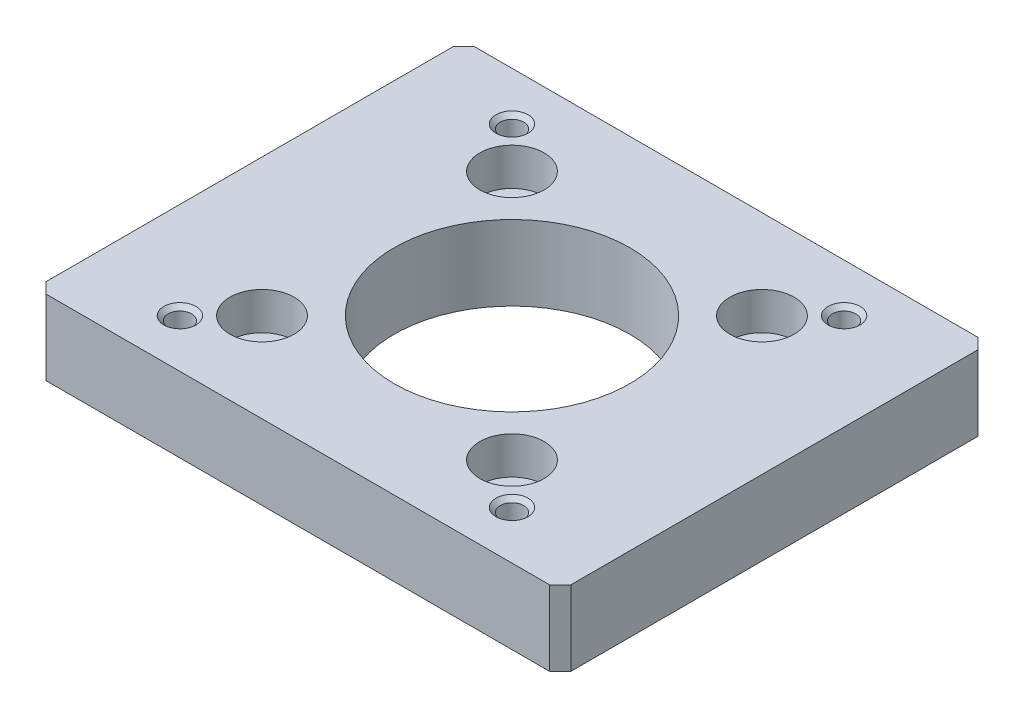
ISO-10303-21;
HEADER;
FILE_DESCRIPTION(('STEP AP214'),'2;1');
FILE_NAME('part.step','',(''),(''),'','','');
FILE_SCHEMA(('AUTOMOTIVE_DESIGN { 1 0 10303 214 1 1 1 1 }'));
ENDSEC;
DATA;
#1=APPLICATION_CONTEXT('core data for automotive mechanical design processes');
#2=APPLICATION_PROTOCOL_DEFINITION('international standard','automotive_design',2000,#1);
#3=PRODUCT_CONTEXT('',#1,'mechanical');
#4=PRODUCT('Part','Part','',(#3));
#5=PRODUCT_RELATED_PRODUCT_CATEGORY('part','',(#4));
#6=PRODUCT_DEFINITION_FORMATION('','',#4);
#7=PRODUCT_DEFINITION_CONTEXT('part definition',#1,'design');
#8=PRODUCT_DEFINITION('design','',#6,#7);
#9=PRODUCT_DEFINITION_SHAPE('','',#8);
#10=(LENGTH_UNIT() NAMED_UNIT(*) SI_UNIT(.MILLI.,.METRE.));
#11=(NAMED_UNIT(*) PLANE_ANGLE_UNIT() SI_UNIT($,.RADIAN.));
#12=(NAMED_UNIT(*) SI_UNIT($,.STERADIAN.) SOLID_ANGLE_UNIT());
#13=UNCERTAINTY_MEASURE_WITH_UNIT(LENGTH_MEASURE(1.E-05),#10,'distance_accuracy_value','');
#14=(GEOMETRIC_REPRESENTATION_CONTEXT(3) GLOBAL_UNCERTAINTY_ASSIGNED_CONTEXT((#13)) GLOBAL_UNIT_ASSIGNED_CONTEXT((#10,
#11,#12)) REPRESENTATION_CONTEXT('',''));
#15=CARTESIAN_POINT('',(0.,0.,0.));
#16=DIRECTION('',(0.,0.,1.));
#17=DIRECTION('',(1.,0.,0.));
#18=AXIS2_PLACEMENT_3D('',#15,#16,#17);
#19=CARTESIAN_POINT('',(-15.5,6.60000000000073,-15.5));
#20=DIRECTION('',(0.,1.,0.));
#21=DIRECTION('',(0.,0.,1.));
#22=AXIS2_PLACEMENT_3D('',#19,#20,#21);
#23=CONICAL_SURFACE('',#22,1.09999999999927,0.785398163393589);
#24=CARTESIAN_POINT('',(-15.5,6.6,-15.5));
#25=DIRECTION('',(0.,1.,0.));
#26=DIRECTION('',(1.,0.,0.));
#27=AXIS2_PLACEMENT_3D('',#24,#25,#26);
#28=CIRCLE('',#27,1.1);
#29=CARTESIAN_POINT('',(-14.4,6.6,-15.5));
#30=VERTEX_POINT('',#29);
#31=EDGE_CURVE('E191',#30,#30,#28,.F.);
#32=ORIENTED_EDGE('',*,*,#31,.T.);
#33=EDGE_LOOP('',(#32));
#34=FACE_BOUND('',#33,.T.);
#35=CARTESIAN_POINT('',(-15.5,7.00000000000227,-15.5));
#36=DIRECTION('',(0.,1.,0.));
#37=DIRECTION('',(0.,0.,1.));
#38=AXIS2_PLACEMENT_3D('',#35,#36,#37);
#39=CIRCLE('',#38,1.49999999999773);
#40=CARTESIAN_POINT('',(-15.5,7.00000000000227,-14.0000000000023));
#41=VERTEX_POINT('',#40);
#42=EDGE_CURVE('E174',#41,#41,#39,.T.);
#43=ORIENTED_EDGE('',*,*,#42,.T.);
#44=EDGE_LOOP('',(#43));
#45=FACE_BOUND('',#44,.T.);
#46=ADVANCED_FACE('F16',(#34,#45),#23,.F.);
#47=CARTESIAN_POINT('',(15.5,6.60000000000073,-15.5));
#48=DIRECTION('',(0.,1.,0.));
#49=DIRECTION('',(0.,0.,1.));
#50=AXIS2_PLACEMENT_3D('',#47,#48,#49);
#51=CONICAL_SURFACE('',#50,1.09999999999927,0.785398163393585);
#52=CARTESIAN_POINT('',(15.5,6.6,-15.5));
#53=DIRECTION('',(0.,1.,0.));
#54=DIRECTION('',(1.,0.,0.));
#55=AXIS2_PLACEMENT_3D('',#52,#53,#54);
#56=CIRCLE('',#55,1.1);
#57=CARTESIAN_POINT('',(16.6,6.6,-15.5));
#58=VERTEX_POINT('',#57);
#59=EDGE_CURVE('E195',#58,#58,#56,.F.);
#60=ORIENTED_EDGE('',*,*,#59,.T.);
#61=EDGE_LOOP('',(#60));
#62=FACE_BOUND('',#61,.T.);
#63=CARTESIAN_POINT('',(15.5,7.00000000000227,-15.5));
#64=DIRECTION('',(0.,1.,0.));
#65=DIRECTION('',(0.,0.,1.));
#66=AXIS2_PLACEMENT_3D('',#63,#64,#65);
#67=CIRCLE('',#66,1.49999999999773);
#68=CARTESIAN_POINT('',(15.5,7.00000000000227,-14.0000000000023));
#69=VERTEX_POINT('',#68);
#70=EDGE_CURVE('E171',#69,#69,#67,.T.);
#71=ORIENTED_EDGE('',*,*,#70,.T.);
#72=EDGE_LOOP('',(#71));
#73=FACE_BOUND('',#72,.T.);
#74=ADVANCED_FACE('F359',(#62,#73),#51,.F.);
#75=CARTESIAN_POINT('',(-15.5,6.60000000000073,15.5));
#76=DIRECTION('',(0.,1.,0.));
#77=DIRECTION('',(-1.,0.,0.));
#78=AXIS2_PLACEMENT_3D('',#75,#76,#77);
#79=CONICAL_SURFACE('',#78,1.09999999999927,0.785398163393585);
#80=CARTESIAN_POINT('',(-15.5,6.6,15.5));
#81=DIRECTION('',(0.,1.,0.));
#82=DIRECTION('',(1.,0.,0.));
#83=AXIS2_PLACEMENT_3D('',#80,#81,#82);
#84=CIRCLE('',#83,1.1);
#85=CARTESIAN_POINT('',(-14.4,6.6,15.5));
#86=VERTEX_POINT('',#85);
#87=EDGE_CURVE('E208',#86,#86,#84,.F.);
#88=ORIENTED_EDGE('',*,*,#87,.T.);
#89=EDGE_LOOP('',(#88));
#90=FACE_BOUND('',#89,.T.);
#91=CARTESIAN_POINT('',(-15.5,7.00000000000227,15.5));
#92=DIRECTION('',(0.,1.,0.));
#93=DIRECTION('',(-1.,0.,0.));
#94=AXIS2_PLACEMENT_3D('',#91,#92,#93);
#95=CIRCLE('',#94,1.49999999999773);
#96=CARTESIAN_POINT('',(-16.9999999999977,7.00000000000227,15.5));
#97=VERTEX_POINT('',#96);
#98=EDGE_CURVE('E168',#97,#97,#95,.T.);
#99=ORIENTED_EDGE('',*,*,#98,.T.);
#100=EDGE_LOOP('',(#99));
#101=FACE_BOUND('',#100,.T.);
#102=ADVANCED_FACE('F355',(#90,#101),#79,.F.);
#103=CARTESIAN_POINT('',(15.5,6.60000000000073,15.5));
#104=DIRECTION('',(0.,1.,0.));
#105=DIRECTION('',(0.,0.,1.));
#106=AXIS2_PLACEMENT_3D('',#103,#104,#105);
#107=CONICAL_SURFACE('',#106,1.09999999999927,0.785398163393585);
#108=CARTESIAN_POINT('',(15.5,6.6,15.5));
#109=DIRECTION('',(0.,1.,0.));
#110=DIRECTION('',(1.,0.,0.));
#111=AXIS2_PLACEMENT_3D('',#108,#109,#110);
#112=CIRCLE('',#111,1.1);
#113=CARTESIAN_POINT('',(16.6,6.6,15.5));
#114=VERTEX_POINT('',#113);
#115=EDGE_CURVE('E200',#114,#114,#112,.F.);
#116=ORIENTED_EDGE('',*,*,#115,.T.);
#117=EDGE_LOOP('',(#116));
#118=FACE_BOUND('',#117,.T.);
#119=CARTESIAN_POINT('',(15.5,7.00000000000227,15.5));
#120=DIRECTION('',(0.,1.,0.));
#121=DIRECTION('',(0.,0.,1.));
#122=AXIS2_PLACEMENT_3D('',#119,#120,#121);
#123=CIRCLE('',#122,1.49999999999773);
#124=CARTESIAN_POINT('',(15.5,7.00000000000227,16.9999999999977));
#125=VERTEX_POINT('',#124);
#126=EDGE_CURVE('E165',#125,#125,#123,.T.);
#127=ORIENTED_EDGE('',*,*,#126,.T.);
#128=EDGE_LOOP('',(#127));
#129=FACE_BOUND('',#128,.T.);
#130=ADVANCED_FACE('F352',(#118,#129),#107,.F.);
#131=CARTESIAN_POINT('',(11.66726188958,3.5,-11.66726188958));
#132=DIRECTION('',(0.,1.,0.));
#133=DIRECTION('',(0.,0.,1.));
#134=AXIS2_PLACEMENT_3D('',#131,#132,#133);
#135=CYLINDRICAL_SURFACE('',#134,3.);
#136=CARTESIAN_POINT('',(11.66726188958,3.5,-11.66726188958));
#137=DIRECTION('',(0.,1.,0.));
#138=DIRECTION('',(0.,0.,1.));
#139=AXIS2_PLACEMENT_3D('',#136,#137,#138);
#140=CIRCLE('',#139,3.);
#141=CARTESIAN_POINT('',(11.66726188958,3.5,-8.66726188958));
#142=VERTEX_POINT('',#141);
#143=EDGE_CURVE('E20',#142,#142,#140,.F.);
#144=ORIENTED_EDGE('',*,*,#143,.T.);
#145=EDGE_LOOP('',(#144));
#146=FACE_BOUND('',#145,.T.);
#147=CARTESIAN_POINT('',(11.66726188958,7.,-11.66726188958));
#148=DIRECTION('',(0.,1.,0.));
#149=DIRECTION('',(0.,0.,1.));
#150=AXIS2_PLACEMENT_3D('',#147,#148,#149);
#151=CIRCLE('',#150,3.);
#152=CARTESIAN_POINT('',(11.66726188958,7.,-8.66726188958));
#153=VERTEX_POINT('',#152);
#154=EDGE_CURVE('E162',#153,#153,#151,.T.);
#155=ORIENTED_EDGE('',*,*,#154,.T.);
#156=EDGE_LOOP('',(#155));
#157=FACE_BOUND('',#156,.T.);
#158=ADVANCED_FACE('F348',(#146,#157),#135,.F.);
#159=CARTESIAN_POINT('',(-11.66726188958,3.5,-11.66726188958));
#160=DIRECTION('',(0.,1.,0.));
#161=DIRECTION('',(0.,0.,1.));
#162=AXIS2_PLACEMENT_3D('',#159,#160,#161);
#163=CYLINDRICAL_SURFACE('',#162,3.000000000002);
#164=CARTESIAN_POINT('',(-11.66726188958,3.5,-11.66726188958));
#165=DIRECTION('',(0.,1.,0.));
#166=DIRECTION('',(0.,0.,1.));
#167=AXIS2_PLACEMENT_3D('',#164,#165,#166);
#168=CIRCLE('',#167,3.000000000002);
#169=CARTESIAN_POINT('',(-11.66726188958,3.5,-8.667261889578));
#170=VERTEX_POINT('',#169);
#171=EDGE_CURVE('E184',#170,#170,#168,.F.);
#172=ORIENTED_EDGE('',*,*,#171,.T.);
#173=EDGE_LOOP('',(#172));
#174=FACE_BOUND('',#173,.T.);
#175=CARTESIAN_POINT('',(-11.66726188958,7.,-11.66726188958));
#176=DIRECTION('',(0.,1.,0.));
#177=DIRECTION('',(0.,0.,1.));
#178=AXIS2_PLACEMENT_3D('',#175,#176,#177);
#179=CIRCLE('',#178,3.000000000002);
#180=CARTESIAN_POINT('',(-11.66726188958,7.,-8.667261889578));
#181=VERTEX_POINT('',#180);
#182=EDGE_CURVE('E159',#181,#181,#179,.T.);
#183=ORIENTED_EDGE('',*,*,#182,.T.);
#184=EDGE_LOOP('',(#183));
#185=FACE_BOUND('',#184,.T.);
#186=ADVANCED_FACE('F344',(#174,#185),#163,.F.);
#187=CARTESIAN_POINT('',(-11.66726188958,3.5,11.66726188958));
#188=DIRECTION('',(0.,1.,0.));
#189=DIRECTION('',(0.,0.,1.));
#190=AXIS2_PLACEMENT_3D('',#187,#188,#189);
#191=CYLINDRICAL_SURFACE('',#190,3.000000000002);
#192=CARTESIAN_POINT('',(-11.66726188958,3.5,11.66726188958));
#193=DIRECTION('',(0.,1.,0.));
#194=DIRECTION('',(0.,0.,1.));
#195=AXIS2_PLACEMENT_3D('',#192,#193,#194);
#196=CIRCLE('',#195,3.000000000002);
#197=CARTESIAN_POINT('',(-11.66726188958,3.5,14.667261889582));
#198=VERTEX_POINT('',#197);
#199=EDGE_CURVE('E90',#198,#198,#196,.F.);
#200=ORIENTED_EDGE('',*,*,#199,.T.);
#201=EDGE_LOOP('',(#200));
#202=FACE_BOUND('',#201,.T.);
#203=CARTESIAN_POINT('',(-11.66726188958,7.,11.66726188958));
#204=DIRECTION('',(0.,1.,0.));
#205=DIRECTION('',(0.,0.,1.));
#206=AXIS2_PLACEMENT_3D('',#203,#204,#205);
#207=CIRCLE('',#206,3.000000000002);
#208=CARTESIAN_POINT('',(-11.66726188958,7.,14.667261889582));
#209=VERTEX_POINT('',#208);
#210=EDGE_CURVE('E107',#209,#209,#207,.T.);
#211=ORIENTED_EDGE('',*,*,#210,.T.);
#212=EDGE_LOOP('',(#211));
#213=FACE_BOUND('',#212,.T.);
#214=ADVANCED_FACE('F341',(#202,#213),#191,.F.);
#215=CARTESIAN_POINT('',(11.66726188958,3.5,11.66726188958));
#216=DIRECTION('',(0.,1.,0.));
#217=DIRECTION('',(0.,0.,1.));
#218=AXIS2_PLACEMENT_3D('',#215,#216,#217);
#219=CYLINDRICAL_SURFACE('',#218,3.);
#220=CARTESIAN_POINT('',(11.66726188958,3.5,11.66726188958));
#221=DIRECTION('',(0.,1.,0.));
#222=DIRECTION('',(0.,0.,1.));
#223=AXIS2_PLACEMENT_3D('',#220,#221,#222);
#224=CIRCLE('',#223,3.);
#225=CARTESIAN_POINT('',(11.66726188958,3.5,14.66726188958));
#226=VERTEX_POINT('',#225);
#227=EDGE_CURVE('E186',#226,#226,#224,.F.);
#228=ORIENTED_EDGE('',*,*,#227,.T.);
#229=EDGE_LOOP('',(#228));
#230=FACE_BOUND('',#229,.T.);
#231=CARTESIAN_POINT('',(11.66726188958,7.,11.66726188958));
#232=DIRECTION('',(0.,1.,0.));
#233=DIRECTION('',(0.,0.,1.));
#234=AXIS2_PLACEMENT_3D('',#231,#232,#233);
#235=CIRCLE('',#234,3.);
#236=CARTESIAN_POINT('',(11.66726188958,7.,14.66726188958));
#237=VERTEX_POINT('',#236);
#238=EDGE_CURVE('E104',#237,#237,#235,.T.);
#239=ORIENTED_EDGE('',*,*,#238,.T.);
#240=EDGE_LOOP('',(#239));
#241=FACE_BOUND('',#240,.T.);
#242=ADVANCED_FACE('F338',(#230,#241),#219,.F.);
#243=CARTESIAN_POINT('',(-24.55903957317,7.14,-18.94096042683));
#244=DIRECTION('',(-0.70710678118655,0.,-0.707106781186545));
#245=DIRECTION('',(0.707106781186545,0.,-0.70710678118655));
#246=AXIS2_PLACEMENT_3D('',#243,#244,#245);
#247=PLANE('',#246);
#248=DIRECTION('',(0.707106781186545,0.,-0.70710678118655));
#249=VECTOR('',#248,1.);
#250=CARTESIAN_POINT('',(-24.55903957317,7.,-18.94096042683));
#251=LINE('',#250,#249);
#252=CARTESIAN_POINT('',(-24.5,7.,-19.));
#253=VERTEX_POINT('',#252);
#254=CARTESIAN_POINT('',(-23.5,7.,-20.));
#255=VERTEX_POINT('',#254);
#256=EDGE_CURVE('E177',#253,#255,#251,.T.);
#257=ORIENTED_EDGE('',*,*,#256,.T.);
#258=DIRECTION('',(0.,1.,0.));
#259=VECTOR('',#258,1.);
#260=CARTESIAN_POINT('',(-23.5,3.5,-20.));
#261=LINE('',#260,#259);
#262=CARTESIAN_POINT('',(-23.5,0.,-20.));
#263=VERTEX_POINT('',#262);
#264=EDGE_CURVE('E100',#255,#263,#261,.F.);
#265=ORIENTED_EDGE('',*,*,#264,.T.);
#266=DIRECTION('',(-0.707106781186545,0.,0.70710678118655));
#267=VECTOR('',#266,1.);
#268=CARTESIAN_POINT('',(-24.,0.,-19.5));
#269=LINE('',#268,#267);
#270=CARTESIAN_POINT('',(-24.5,0.,-19.));
#271=VERTEX_POINT('',#270);
#272=EDGE_CURVE('E203',#271,#263,#269,.F.);
#273=ORIENTED_EDGE('',*,*,#272,.F.);
#274=DIRECTION('',(0.,-1.,0.));
#275=VECTOR('',#274,1.);
#276=CARTESIAN_POINT('',(-24.5,3.5,-19.));
#277=LINE('',#276,#275);
#278=EDGE_CURVE('E215',#271,#253,#277,.F.);
#279=ORIENTED_EDGE('',*,*,#278,.T.);
#280=EDGE_LOOP('',(#257,#265,#273,#279));
#281=FACE_BOUND('',#280,.T.);
#282=ADVANCED_FACE('F261',(#281),#247,.T.);
#283=CARTESIAN_POINT('',(-23.44096042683,7.14,20.05903957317));
#284=DIRECTION('',(-0.70710678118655,0.,0.707106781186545));
#285=DIRECTION('',(-0.707106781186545,0.,-0.70710678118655));
#286=AXIS2_PLACEMENT_3D('',#283,#284,#285);
#287=PLANE('',#286);
#288=DIRECTION('',(-0.707106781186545,0.,-0.70710678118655));
#289=VECTOR('',#288,1.);
#290=CARTESIAN_POINT('',(-23.44096042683,7.,20.05903957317));
#291=LINE('',#290,#289);
#292=CARTESIAN_POINT('',(-23.5,7.,20.));
#293=VERTEX_POINT('',#292);
#294=CARTESIAN_POINT('',(-24.5,7.,19.));
#295=VERTEX_POINT('',#294);
#296=EDGE_CURVE('E179',#293,#295,#291,.T.);
#297=ORIENTED_EDGE('',*,*,#296,.T.);
#298=DIRECTION('',(0.,1.,0.));
#299=VECTOR('',#298,1.);
#300=CARTESIAN_POINT('',(-24.5,3.5,19.));
#301=LINE('',#300,#299);
#302=CARTESIAN_POINT('',(-24.5,0.,19.));
#303=VERTEX_POINT('',#302);
#304=EDGE_CURVE('E214',#295,#303,#301,.F.);
#305=ORIENTED_EDGE('',*,*,#304,.T.);
#306=DIRECTION('',(0.707106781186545,0.,0.70710678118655));
#307=VECTOR('',#306,1.);
#308=CARTESIAN_POINT('',(-24.,0.,19.5));
#309=LINE('',#308,#307);
#310=CARTESIAN_POINT('',(-23.5,0.,20.));
#311=VERTEX_POINT('',#310);
#312=EDGE_CURVE('E257',#311,#303,#309,.F.);
#313=ORIENTED_EDGE('',*,*,#312,.F.);
#314=DIRECTION('',(0.,-1.,0.));
#315=VECTOR('',#314,1.);
#316=CARTESIAN_POINT('',(-23.5,3.5,20.));
#317=LINE('',#316,#315);
#318=EDGE_CURVE('E222',#311,#293,#317,.F.);
#319=ORIENTED_EDGE('',*,*,#318,.T.);
#320=EDGE_LOOP('',(#297,#305,#313,#319));
#321=FACE_BOUND('',#320,.T.);
#322=ADVANCED_FACE('F267',(#321),#287,.T.);
#323=CARTESIAN_POINT('',(23.44096042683,7.14,-20.05903957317));
#324=DIRECTION('',(0.70710678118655,0.,-0.707106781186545));
#325=DIRECTION('',(0.707106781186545,0.,0.70710678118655));
#326=AXIS2_PLACEMENT_3D('',#323,#324,#325);
#327=PLANE('',#326);
#328=DIRECTION('',(0.707106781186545,0.,0.70710678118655));
#329=VECTOR('',#328,1.);
#330=CARTESIAN_POINT('',(23.44096042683,7.,-20.05903957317));
#331=LINE('',#330,#329);
#332=CARTESIAN_POINT('',(23.5,7.,-20.));
#333=VERTEX_POINT('',#332);
#334=CARTESIAN_POINT('',(24.5,7.,-19.));
#335=VERTEX_POINT('',#334);
#336=EDGE_CURVE('E80',#333,#335,#331,.T.);
#337=ORIENTED_EDGE('',*,*,#336,.T.);
#338=DIRECTION('',(0.,1.,0.));
#339=VECTOR('',#338,1.);
#340=CARTESIAN_POINT('',(24.5,3.5,-19.));
#341=LINE('',#340,#339);
#342=CARTESIAN_POINT('',(24.5,0.,-19.));
#343=VERTEX_POINT('',#342);
#344=EDGE_CURVE('E113',#335,#343,#341,.F.);
#345=ORIENTED_EDGE('',*,*,#344,.T.);
#346=DIRECTION('',(-0.707106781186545,0.,-0.70710678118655));
#347=VECTOR('',#346,1.);
#348=CARTESIAN_POINT('',(24.,0.,-19.5));
#349=LINE('',#348,#347);
#350=CARTESIAN_POINT('',(23.5,0.,-20.));
#351=VERTEX_POINT('',#350);
#352=EDGE_CURVE('E103',#351,#343,#349,.F.);
#353=ORIENTED_EDGE('',*,*,#352,.F.);
#354=DIRECTION('',(0.,-1.,0.));
#355=VECTOR('',#354,1.);
#356=CARTESIAN_POINT('',(23.5,3.5,-20.));
#357=LINE('',#356,#355);
#358=EDGE_CURVE('E97',#351,#333,#357,.F.);
#359=ORIENTED_EDGE('',*,*,#358,.T.);
#360=EDGE_LOOP('',(#337,#345,#353,#359));
#361=FACE_BOUND('',#360,.T.);
#362=ADVANCED_FACE('F102',(#361),#327,.T.);
#363=CARTESIAN_POINT('',(24.55903957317,7.14,18.94096042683));
#364=DIRECTION('',(0.70710678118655,0.,0.707106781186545));
#365=DIRECTION('',(-0.707106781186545,0.,0.70710678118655));
#366=AXIS2_PLACEMENT_3D('',#363,#364,#365);
#367=PLANE('',#366);
#368=DIRECTION('',(-0.707106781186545,0.,0.70710678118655));
#369=VECTOR('',#368,1.);
#370=CARTESIAN_POINT('',(24.55903957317,7.,18.94096042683));
#371=LINE('',#370,#369);
#372=CARTESIAN_POINT('',(24.5,7.,19.));
#373=VERTEX_POINT('',#372);
#374=CARTESIAN_POINT('',(23.5,7.,20.));
#375=VERTEX_POINT('',#374);
#376=EDGE_CURVE('E89',#373,#375,#371,.T.);
#377=ORIENTED_EDGE('',*,*,#376,.T.);
#378=DIRECTION('',(0.,1.,0.));
#379=VECTOR('',#378,1.);
#380=CARTESIAN_POINT('',(23.5,3.5,20.));
#381=LINE('',#380,#379);
#382=CARTESIAN_POINT('',(23.5,0.,20.));
#383=VERTEX_POINT('',#382);
#384=EDGE_CURVE('E111',#375,#383,#381,.F.);
#385=ORIENTED_EDGE('',*,*,#384,.T.);
#386=DIRECTION('',(0.707106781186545,0.,-0.70710678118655));
#387=VECTOR('',#386,1.);
#388=CARTESIAN_POINT('',(24.,0.,19.5));
#389=LINE('',#388,#387);
#390=CARTESIAN_POINT('',(24.5,0.,19.));
#391=VERTEX_POINT('',#390);
#392=EDGE_CURVE('E35',#391,#383,#389,.F.);
#393=ORIENTED_EDGE('',*,*,#392,.F.);
#394=DIRECTION('',(0.,-1.,0.));
#395=VECTOR('',#394,1.);
#396=CARTESIAN_POINT('',(24.5,3.5,19.));
#397=LINE('',#396,#395);
#398=EDGE_CURVE('E114',#391,#373,#397,.F.);
#399=ORIENTED_EDGE('',*,*,#398,.T.);
#400=EDGE_LOOP('',(#377,#385,#393,#399));
#401=FACE_BOUND('',#400,.T.);
#402=ADVANCED_FACE('F228',(#401),#367,.T.);
#403=CARTESIAN_POINT('',(-15.5,0.4,15.5));
#404=DIRECTION('',(0.,1.,0.));
#405=DIRECTION('',(0.,0.,1.));
#406=AXIS2_PLACEMENT_3D('',#403,#404,#405);
#407=CYLINDRICAL_SURFACE('',#406,1.1);
#408=CARTESIAN_POINT('',(-15.5,0.399999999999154,15.5));
#409=DIRECTION('',(0.,-1.,0.));
#410=DIRECTION('',(0.,0.,-1.));
#411=AXIS2_PLACEMENT_3D('',#408,#409,#410);
#412=CIRCLE('',#411,1.09999999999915);
#413=CARTESIAN_POINT('',(-15.5,0.399999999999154,14.4000000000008));
#414=VERTEX_POINT('',#413);
#415=EDGE_CURVE('E227',#414,#414,#412,.T.);
#416=ORIENTED_EDGE('',*,*,#415,.T.);
#417=EDGE_LOOP('',(#416));
#418=FACE_BOUND('',#417,.T.);
#419=ORIENTED_EDGE('',*,*,#87,.F.);
#420=EDGE_LOOP('',(#419));
#421=FACE_BOUND('',#420,.T.);
#422=ADVANCED_FACE('F333',(#418,#421),#407,.F.);
#423=CARTESIAN_POINT('',(15.5,0.4,15.5));
#424=DIRECTION('',(0.,1.,0.));
#425=DIRECTION('',(0.,0.,1.));
#426=AXIS2_PLACEMENT_3D('',#423,#424,#425);
#427=CYLINDRICAL_SURFACE('',#426,1.1);
#428=CARTESIAN_POINT('',(15.5,0.399999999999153,15.5));
#429=DIRECTION('',(0.,-1.,0.));
#430=DIRECTION('',(0.,0.,-1.));
#431=AXIS2_PLACEMENT_3D('',#428,#429,#430);
#432=CIRCLE('',#431,1.09999999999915);
#433=CARTESIAN_POINT('',(15.5,0.399999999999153,14.4000000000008));
#434=VERTEX_POINT('',#433);
#435=EDGE_CURVE('E251',#434,#434,#432,.T.);
#436=ORIENTED_EDGE('',*,*,#435,.T.);
#437=EDGE_LOOP('',(#436));
#438=FACE_BOUND('',#437,.T.);
#439=ORIENTED_EDGE('',*,*,#115,.F.);
#440=EDGE_LOOP('',(#439));
#441=FACE_BOUND('',#440,.T.);
#442=ADVANCED_FACE('F329',(#438,#441),#427,.F.);
#443=CARTESIAN_POINT('',(15.5,0.4,-15.5));
#444=DIRECTION('',(0.,1.,0.));
#445=DIRECTION('',(0.,0.,1.));
#446=AXIS2_PLACEMENT_3D('',#443,#444,#445);
#447=CYLINDRICAL_SURFACE('',#446,1.1);
#448=CARTESIAN_POINT('',(15.5,0.399999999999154,-15.5));
#449=DIRECTION('',(0.,-1.,0.));
#450=DIRECTION('',(0.,0.,-1.));
#451=AXIS2_PLACEMENT_3D('',#448,#449,#450);
#452=CIRCLE('',#451,1.09999999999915);
#453=CARTESIAN_POINT('',(15.5,0.399999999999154,-16.5999999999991));
#454=VERTEX_POINT('',#453);
#455=EDGE_CURVE('E248',#454,#454,#452,.T.);
#456=ORIENTED_EDGE('',*,*,#455,.T.);
#457=EDGE_LOOP('',(#456));
#458=FACE_BOUND('',#457,.T.);
#459=ORIENTED_EDGE('',*,*,#59,.F.);
#460=EDGE_LOOP('',(#459));
#461=FACE_BOUND('',#460,.T.);
#462=ADVANCED_FACE('F325',(#458,#461),#447,.F.);
#463=CARTESIAN_POINT('',(-15.5,0.4,-15.5));
#464=DIRECTION('',(0.,1.,0.));
#465=DIRECTION('',(0.,0.,1.));
#466=AXIS2_PLACEMENT_3D('',#463,#464,#465);
#467=CYLINDRICAL_SURFACE('',#466,1.1);
#468=CARTESIAN_POINT('',(-15.5,0.399999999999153,-15.5));
#469=DIRECTION('',(0.,-1.,0.));
#470=DIRECTION('',(0.,0.,-1.));
#471=AXIS2_PLACEMENT_3D('',#468,#469,#470);
#472=CIRCLE('',#471,1.09999999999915);
#473=CARTESIAN_POINT('',(-15.5,0.399999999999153,-16.5999999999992));
#474=VERTEX_POINT('',#473);
#475=EDGE_CURVE('E155',#474,#474,#472,.T.);
#476=ORIENTED_EDGE('',*,*,#475,.T.);
#477=EDGE_LOOP('',(#476));
#478=FACE_BOUND('',#477,.T.);
#479=ORIENTED_EDGE('',*,*,#31,.F.);
#480=EDGE_LOOP('',(#479));
#481=FACE_BOUND('',#480,.T.);
#482=ADVANCED_FACE('F321',(#478,#481),#467,.F.);
#483=CARTESIAN_POINT('',(-15.25395236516,3.5,15.26045421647));
#484=DIRECTION('',(0.,1.,0.));
#485=DIRECTION('',(1.,0.,0.));
#486=AXIS2_PLACEMENT_3D('',#483,#484,#485);
#487=PLANE('',#486);
#488=CARTESIAN_POINT('',(11.66726188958,3.5,-11.66726188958));
#489=DIRECTION('',(0.,1.,0.));
#490=DIRECTION('',(0.,0.,1.));
#491=AXIS2_PLACEMENT_3D('',#488,#489,#490);
#492=CIRCLE('',#491,1.75);
#493=CARTESIAN_POINT('',(11.66726188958,3.5,-9.91726188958));
#494=VERTEX_POINT('',#493);
#495=EDGE_CURVE('E153',#494,#494,#492,.F.);
#496=ORIENTED_EDGE('',*,*,#495,.T.);
#497=EDGE_LOOP('',(#496));
#498=FACE_BOUND('',#497,.T.);
#499=ORIENTED_EDGE('',*,*,#143,.F.);
#500=EDGE_LOOP('',(#499));
#501=FACE_BOUND('',#500,.T.);
#502=ADVANCED_FACE('F324',(#498,#501),#487,.T.);
#503=CARTESIAN_POINT('',(-15.25395236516,3.5,15.26045421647));
#504=DIRECTION('',(0.,1.,0.));
#505=DIRECTION('',(1.,0.,0.));
#506=AXIS2_PLACEMENT_3D('',#503,#504,#505);
#507=PLANE('',#506);
#508=CARTESIAN_POINT('',(11.66726188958,3.5,11.66726188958));
#509=DIRECTION('',(0.,1.,0.));
#510=DIRECTION('',(0.,0.,1.));
#511=AXIS2_PLACEMENT_3D('',#508,#509,#510);
#512=CIRCLE('',#511,1.75);
#513=CARTESIAN_POINT('',(11.66726188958,3.5,13.41726188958));
#514=VERTEX_POINT('',#513);
#515=EDGE_CURVE('E150',#514,#514,#512,.F.);
#516=ORIENTED_EDGE('',*,*,#515,.T.);
#517=EDGE_LOOP('',(#516));
#518=FACE_BOUND('',#517,.T.);
#519=ORIENTED_EDGE('',*,*,#227,.F.);
#520=EDGE_LOOP('',(#519));
#521=FACE_BOUND('',#520,.T.);
#522=ADVANCED_FACE('F376',(#518,#521),#507,.T.);
#523=CARTESIAN_POINT('',(-15.25395236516,3.5,15.26045421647));
#524=DIRECTION('',(0.,1.,0.));
#525=DIRECTION('',(1.,0.,0.));
#526=AXIS2_PLACEMENT_3D('',#523,#524,#525);
#527=PLANE('',#526);
#528=CARTESIAN_POINT('',(-11.66726188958,3.5,-11.66726188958));
#529=DIRECTION('',(0.,1.,0.));
#530=DIRECTION('',(0.,0.,1.));
#531=AXIS2_PLACEMENT_3D('',#528,#529,#530);
#532=CIRCLE('',#531,1.75000000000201);
#533=CARTESIAN_POINT('',(-11.66726188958,3.5,-9.917261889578));
#534=VERTEX_POINT('',#533);
#535=EDGE_CURVE('E147',#534,#534,#532,.F.);
#536=ORIENTED_EDGE('',*,*,#535,.T.);
#537=EDGE_LOOP('',(#536));
#538=FACE_BOUND('',#537,.T.);
#539=ORIENTED_EDGE('',*,*,#171,.F.);
#540=EDGE_LOOP('',(#539));
#541=FACE_BOUND('',#540,.T.);
#542=ADVANCED_FACE('F380',(#538,#541),#527,.T.);
#543=CARTESIAN_POINT('',(-15.25395236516,3.5,15.26045421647));
#544=DIRECTION('',(0.,1.,0.));
#545=DIRECTION('',(1.,0.,0.));
#546=AXIS2_PLACEMENT_3D('',#543,#544,#545);
#547=PLANE('',#546);
#548=CARTESIAN_POINT('',(-11.66726188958,3.5,11.66726188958));
#549=DIRECTION('',(0.,1.,0.));
#550=DIRECTION('',(0.,0.,1.));
#551=AXIS2_PLACEMENT_3D('',#548,#549,#550);
#552=CIRCLE('',#551,1.75000000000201);
#553=CARTESIAN_POINT('',(-11.66726188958,3.5,13.417261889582));
#554=VERTEX_POINT('',#553);
#555=EDGE_CURVE('E144',#554,#554,#552,.F.);
#556=ORIENTED_EDGE('',*,*,#555,.T.);
#557=EDGE_LOOP('',(#556));
#558=FACE_BOUND('',#557,.T.);
#559=ORIENTED_EDGE('',*,*,#199,.F.);
#560=EDGE_LOOP('',(#559));
#561=FACE_BOUND('',#560,.T.);
#562=ADVANCED_FACE('F384',(#558,#561),#547,.T.);
#563=CARTESIAN_POINT('',(-25.48,7.,20.8));
#564=DIRECTION('',(0.,1.,0.));
#565=DIRECTION('',(1.,0.,0.));
#566=AXIS2_PLACEMENT_3D('',#563,#564,#565);
#567=PLANE('',#566);
#568=CARTESIAN_POINT('',(0.,7.,0.));
#569=DIRECTION('',(0.,1.,0.));
#570=DIRECTION('',(0.,0.,1.));
#571=AXIS2_PLACEMENT_3D('',#568,#569,#570);
#572=CIRCLE('',#571,11.);
#573=CARTESIAN_POINT('',(0.,7.,11.));
#574=VERTEX_POINT('',#573);
#575=EDGE_CURVE('E140',#574,#574,#572,.F.);
#576=ORIENTED_EDGE('',*,*,#575,.T.);
#577=EDGE_LOOP('',(#576));
#578=FACE_BOUND('',#577,.T.);
#579=ORIENTED_EDGE('',*,*,#238,.F.);
#580=EDGE_LOOP('',(#579));
#581=FACE_BOUND('',#580,.T.);
#582=ORIENTED_EDGE('',*,*,#210,.F.);
#583=EDGE_LOOP('',(#582));
#584=FACE_BOUND('',#583,.T.);
#585=ORIENTED_EDGE('',*,*,#182,.F.);
#586=EDGE_LOOP('',(#585));
#587=FACE_BOUND('',#586,.T.);
#588=ORIENTED_EDGE('',*,*,#154,.F.);
#589=EDGE_LOOP('',(#588));
#590=FACE_BOUND('',#589,.T.);
#591=ORIENTED_EDGE('',*,*,#126,.F.);
#592=EDGE_LOOP('',(#591));
#593=FACE_BOUND('',#592,.T.);
#594=ORIENTED_EDGE('',*,*,#98,.F.);
#595=EDGE_LOOP('',(#594));
#596=FACE_BOUND('',#595,.T.);
#597=ORIENTED_EDGE('',*,*,#70,.F.);
#598=EDGE_LOOP('',(#597));
#599=FACE_BOUND('',#598,.T.);
#600=ORIENTED_EDGE('',*,*,#42,.F.);
#601=EDGE_LOOP('',(#600));
#602=FACE_BOUND('',#601,.T.);
#603=ORIENTED_EDGE('',*,*,#256,.F.);
#604=DIRECTION('',(0.,0.,-1.));
#605=VECTOR('',#604,1.);
#606=CARTESIAN_POINT('',(-24.5,7.,0.));
#607=LINE('',#606,#605);
#608=EDGE_CURVE('E211',#253,#295,#607,.F.);
#609=ORIENTED_EDGE('',*,*,#608,.T.);
#610=ORIENTED_EDGE('',*,*,#296,.F.);
#611=DIRECTION('',(-1.,0.,0.));
#612=VECTOR('',#611,1.);
#613=CARTESIAN_POINT('',(0.,7.,20.));
#614=LINE('',#613,#612);
#615=EDGE_CURVE('E219',#293,#375,#614,.F.);
#616=ORIENTED_EDGE('',*,*,#615,.T.);
#617=ORIENTED_EDGE('',*,*,#376,.F.);
#618=DIRECTION('',(0.,0.,1.));
#619=VECTOR('',#618,1.);
#620=CARTESIAN_POINT('',(24.5,7.,0.));
#621=LINE('',#620,#619);
#622=EDGE_CURVE('E85',#373,#335,#621,.F.);
#623=ORIENTED_EDGE('',*,*,#622,.T.);
#624=ORIENTED_EDGE('',*,*,#336,.F.);
#625=DIRECTION('',(1.,0.,0.));
#626=VECTOR('',#625,1.);
#627=CARTESIAN_POINT('',(0.,7.,-20.));
#628=LINE('',#627,#626);
#629=EDGE_CURVE('E83',#333,#255,#628,.F.);
#630=ORIENTED_EDGE('',*,*,#629,.T.);
#631=EDGE_LOOP('',(#603,#609,#610,#616,#617,#623,#624,#630));
#632=FACE_BOUND('',#631,.T.);
#633=ADVANCED_FACE('F82',(#578,#581,#584,#587,#590,#593,#596,#599,#602,#632),#567,.T.);
#634=CARTESIAN_POINT('',(24.44,-0.14,-20.));
#635=DIRECTION('',(0.,0.,-1.));
#636=DIRECTION('',(-1.,0.,0.));
#637=AXIS2_PLACEMENT_3D('',#634,#635,#636);
#638=PLANE('',#637);
#639=ORIENTED_EDGE('',*,*,#264,.F.);
#640=ORIENTED_EDGE('',*,*,#629,.F.);
#641=ORIENTED_EDGE('',*,*,#358,.F.);
#642=DIRECTION('',(-1.,0.,0.));
#643=VECTOR('',#642,1.);
#644=CARTESIAN_POINT('',(0.,0.,-20.));
#645=LINE('',#644,#643);
#646=EDGE_CURVE('E143',#351,#263,#645,.T.);
#647=ORIENTED_EDGE('',*,*,#646,.T.);
#648=EDGE_LOOP('',(#639,#640,#641,#647));
#649=FACE_BOUND('',#648,.T.);
#650=ADVANCED_FACE('F95',(#649),#638,.T.);
#651=CARTESIAN_POINT('',(-24.5,-0.14,-19.76));
#652=DIRECTION('',(-1.,0.,0.));
#653=DIRECTION('',(0.,0.,1.));
#654=AXIS2_PLACEMENT_3D('',#651,#652,#653);
#655=PLANE('',#654);
#656=ORIENTED_EDGE('',*,*,#304,.F.);
#657=ORIENTED_EDGE('',*,*,#608,.F.);
#658=ORIENTED_EDGE('',*,*,#278,.F.);
#659=DIRECTION('',(0.,0.,1.));
#660=VECTOR('',#659,1.);
#661=CARTESIAN_POINT('',(-24.5,0.,0.));
#662=LINE('',#661,#660);
#663=EDGE_CURVE('E240',#271,#303,#662,.T.);
#664=ORIENTED_EDGE('',*,*,#663,.T.);
#665=EDGE_LOOP('',(#656,#657,#658,#664));
#666=FACE_BOUND('',#665,.T.);
#667=ADVANCED_FACE('F265',(#666),#655,.T.);
#668=CARTESIAN_POINT('',(-24.44,-0.14,20.));
#669=DIRECTION('',(0.,0.,1.));
#670=DIRECTION('',(1.,0.,0.));
#671=AXIS2_PLACEMENT_3D('',#668,#669,#670);
#672=PLANE('',#671);
#673=ORIENTED_EDGE('',*,*,#384,.F.);
#674=ORIENTED_EDGE('',*,*,#615,.F.);
#675=ORIENTED_EDGE('',*,*,#318,.F.);
#676=DIRECTION('',(1.,0.,0.));
#677=VECTOR('',#676,1.);
#678=CARTESIAN_POINT('',(0.,0.,20.));
#679=LINE('',#678,#677);
#680=EDGE_CURVE('E237',#311,#383,#679,.T.);
#681=ORIENTED_EDGE('',*,*,#680,.T.);
#682=EDGE_LOOP('',(#673,#674,#675,#681));
#683=FACE_BOUND('',#682,.T.);
#684=ADVANCED_FACE('F271',(#683),#672,.T.);
#685=CARTESIAN_POINT('',(24.5,-0.14,19.76));
#686=DIRECTION('',(1.,0.,0.));
#687=DIRECTION('',(0.,0.,-1.));
#688=AXIS2_PLACEMENT_3D('',#685,#686,#687);
#689=PLANE('',#688);
#690=ORIENTED_EDGE('',*,*,#398,.F.);
#691=DIRECTION('',(0.,0.,-1.));
#692=VECTOR('',#691,1.);
#693=CARTESIAN_POINT('',(24.5,0.,0.));
#694=LINE('',#693,#692);
#695=EDGE_CURVE('E139',#391,#343,#694,.T.);
#696=ORIENTED_EDGE('',*,*,#695,.T.);
#697=ORIENTED_EDGE('',*,*,#344,.F.);
#698=ORIENTED_EDGE('',*,*,#622,.F.);
#699=EDGE_LOOP('',(#690,#696,#697,#698));
#700=FACE_BOUND('',#699,.T.);
#701=ADVANCED_FACE('F233',(#700),#689,.T.);
#702=CARTESIAN_POINT('',(-15.5,0.399999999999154,15.5));
#703=DIRECTION('',(0.,-1.,0.));
#704=DIRECTION('',(1.,0.,0.));
#705=AXIS2_PLACEMENT_3D('',#702,#703,#704);
#706=CONICAL_SURFACE('',#705,1.09999999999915,0.785398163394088);
#707=ORIENTED_EDGE('',*,*,#415,.F.);
#708=EDGE_LOOP('',(#707));
#709=FACE_BOUND('',#708,.T.);
#710=CARTESIAN_POINT('',(-15.5,-2.19252784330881E-12,15.5));
#711=DIRECTION('',(0.,-1.,0.));
#712=DIRECTION('',(1.,0.,0.));
#713=AXIS2_PLACEMENT_3D('',#710,#711,#712);
#714=CIRCLE('',#713,1.49999999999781);
#715=CARTESIAN_POINT('',(-14.0000000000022,-2.19256480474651E-12,15.5));
#716=VERTEX_POINT('',#715);
#717=EDGE_CURVE('E136',#716,#716,#714,.T.);
#718=ORIENTED_EDGE('',*,*,#717,.T.);
#719=EDGE_LOOP('',(#718));
#720=FACE_BOUND('',#719,.T.);
#721=ADVANCED_FACE('F279',(#709,#720),#706,.F.);
#722=CARTESIAN_POINT('',(15.5,0.399999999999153,15.5));
#723=DIRECTION('',(0.,-1.,0.));
#724=DIRECTION('',(1.,0.,0.));
#725=AXIS2_PLACEMENT_3D('',#722,#723,#724);
#726=CONICAL_SURFACE('',#725,1.09999999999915,0.785398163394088);
#727=ORIENTED_EDGE('',*,*,#435,.F.);
#728=EDGE_LOOP('',(#727));
#729=FACE_BOUND('',#728,.T.);
#730=CARTESIAN_POINT('',(15.5,-2.1911725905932E-12,15.5));
#731=DIRECTION('',(0.,-1.,0.));
#732=DIRECTION('',(1.,0.,0.));
#733=AXIS2_PLACEMENT_3D('',#730,#731,#732);
#734=CIRCLE('',#733,1.49999999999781);
#735=CARTESIAN_POINT('',(16.9999999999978,-2.1912095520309E-12,15.5));
#736=VERTEX_POINT('',#735);
#737=EDGE_CURVE('E133',#736,#736,#734,.T.);
#738=ORIENTED_EDGE('',*,*,#737,.T.);
#739=EDGE_LOOP('',(#738));
#740=FACE_BOUND('',#739,.T.);
#741=ADVANCED_FACE('F309',(#729,#740),#726,.F.);
#742=CARTESIAN_POINT('',(15.5,0.399999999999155,-15.5));
#743=DIRECTION('',(0.,-1.,0.));
#744=DIRECTION('',(0.,0.,-1.));
#745=AXIS2_PLACEMENT_3D('',#742,#743,#744);
#746=CONICAL_SURFACE('',#745,1.09999999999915,0.785398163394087);
#747=ORIENTED_EDGE('',*,*,#455,.F.);
#748=EDGE_LOOP('',(#747));
#749=FACE_BOUND('',#748,.T.);
#750=CARTESIAN_POINT('',(15.5,-2.19225679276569E-12,-15.5));
#751=DIRECTION('',(0.,-1.,0.));
#752=DIRECTION('',(0.,0.,-1.));
#753=AXIS2_PLACEMENT_3D('',#750,#751,#752);
#754=CIRCLE('',#753,1.49999999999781);
#755=CARTESIAN_POINT('',(15.5,-2.19225679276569E-12,-16.9999999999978));
#756=VERTEX_POINT('',#755);
#757=EDGE_CURVE('E130',#756,#756,#754,.T.);
#758=ORIENTED_EDGE('',*,*,#757,.T.);
#759=EDGE_LOOP('',(#758));
#760=FACE_BOUND('',#759,.T.);
#761=ADVANCED_FACE('F315',(#749,#760),#746,.F.);
#762=CARTESIAN_POINT('',(-15.5,0.399999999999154,-15.5));
#763=DIRECTION('',(0.,-1.,0.));
#764=DIRECTION('',(0.,0.,-1.));
#765=AXIS2_PLACEMENT_3D('',#762,#763,#764);
#766=CONICAL_SURFACE('',#765,1.09999999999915,0.785398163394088);
#767=ORIENTED_EDGE('',*,*,#475,.F.);
#768=EDGE_LOOP('',(#767));
#769=FACE_BOUND('',#768,.T.);
#770=CARTESIAN_POINT('',(-15.5,-2.1913894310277E-12,-15.5));
#771=DIRECTION('',(0.,-1.,0.));
#772=DIRECTION('',(0.,0.,-1.));
#773=AXIS2_PLACEMENT_3D('',#770,#771,#772);
#774=CIRCLE('',#773,1.49999999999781);
#775=CARTESIAN_POINT('',(-15.5,-2.1913894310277E-12,-16.9999999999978));
#776=VERTEX_POINT('',#775);
#777=EDGE_CURVE('E127',#776,#776,#774,.T.);
#778=ORIENTED_EDGE('',*,*,#777,.T.);
#779=EDGE_LOOP('',(#778));
#780=FACE_BOUND('',#779,.T.);
#781=ADVANCED_FACE('F435',(#769,#780),#766,.F.);
#782=CARTESIAN_POINT('',(11.66726188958,0.,-11.66726188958));
#783=DIRECTION('',(0.,1.,0.));
#784=DIRECTION('',(0.,0.,1.));
#785=AXIS2_PLACEMENT_3D('',#782,#783,#784);
#786=CYLINDRICAL_SURFACE('',#785,1.75);
#787=CARTESIAN_POINT('',(11.66726188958,0.,-11.66726188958));
#788=DIRECTION('',(0.,1.,0.));
#789=DIRECTION('',(0.,0.,1.));
#790=AXIS2_PLACEMENT_3D('',#787,#788,#789);
#791=CIRCLE('',#790,1.75);
#792=CARTESIAN_POINT('',(11.66726188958,0.,-9.91726188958));
#793=VERTEX_POINT('',#792);
#794=EDGE_CURVE('E124',#793,#793,#791,.F.);
#795=ORIENTED_EDGE('',*,*,#794,.T.);
#796=EDGE_LOOP('',(#795));
#797=FACE_BOUND('',#796,.T.);
#798=ORIENTED_EDGE('',*,*,#495,.F.);
#799=EDGE_LOOP('',(#798));
#800=FACE_BOUND('',#799,.T.);
#801=ADVANCED_FACE('F444',(#797,#800),#786,.F.);
#802=CARTESIAN_POINT('',(11.66726188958,0.,11.66726188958));
#803=DIRECTION('',(0.,1.,0.));
#804=DIRECTION('',(0.,0.,1.));
#805=AXIS2_PLACEMENT_3D('',#802,#803,#804);
#806=CYLINDRICAL_SURFACE('',#805,1.75);
#807=CARTESIAN_POINT('',(11.66726188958,0.,11.66726188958));
#808=DIRECTION('',(0.,1.,0.));
#809=DIRECTION('',(0.,0.,1.));
#810=AXIS2_PLACEMENT_3D('',#807,#808,#809);
#811=CIRCLE('',#810,1.75);
#812=CARTESIAN_POINT('',(11.66726188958,0.,13.41726188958));
#813=VERTEX_POINT('',#812);
#814=EDGE_CURVE('E121',#813,#813,#811,.F.);
#815=ORIENTED_EDGE('',*,*,#814,.T.);
#816=EDGE_LOOP('',(#815));
#817=FACE_BOUND('',#816,.T.);
#818=ORIENTED_EDGE('',*,*,#515,.F.);
#819=EDGE_LOOP('',(#818));
#820=FACE_BOUND('',#819,.T.);
#821=ADVANCED_FACE('F454',(#817,#820),#806,.F.);
#822=CARTESIAN_POINT('',(-11.66726188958,0.,-11.66726188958));
#823=DIRECTION('',(0.,1.,0.));
#824=DIRECTION('',(0.,0.,1.));
#825=AXIS2_PLACEMENT_3D('',#822,#823,#824);
#826=CYLINDRICAL_SURFACE('',#825,1.75000000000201);
#827=CARTESIAN_POINT('',(-11.66726188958,0.,-11.66726188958));
#828=DIRECTION('',(0.,1.,0.));
#829=DIRECTION('',(0.,0.,1.));
#830=AXIS2_PLACEMENT_3D('',#827,#828,#829);
#831=CIRCLE('',#830,1.75000000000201);
#832=CARTESIAN_POINT('',(-11.66726188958,0.,-9.917261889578));
#833=VERTEX_POINT('',#832);
#834=EDGE_CURVE('E118',#833,#833,#831,.F.);
#835=ORIENTED_EDGE('',*,*,#834,.T.);
#836=EDGE_LOOP('',(#835));
#837=FACE_BOUND('',#836,.T.);
#838=ORIENTED_EDGE('',*,*,#535,.F.);
#839=EDGE_LOOP('',(#838));
#840=FACE_BOUND('',#839,.T.);
#841=ADVANCED_FACE('F464',(#837,#840),#826,.F.);
#842=CARTESIAN_POINT('',(-11.66726188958,0.,11.66726188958));
#843=DIRECTION('',(0.,1.,0.));
#844=DIRECTION('',(0.,0.,1.));
#845=AXIS2_PLACEMENT_3D('',#842,#843,#844);
#846=CYLINDRICAL_SURFACE('',#845,1.75000000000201);
#847=CARTESIAN_POINT('',(-11.66726188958,0.,11.66726188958));
#848=DIRECTION('',(0.,1.,0.));
#849=DIRECTION('',(0.,0.,1.));
#850=AXIS2_PLACEMENT_3D('',#847,#848,#849);
#851=CIRCLE('',#850,1.75000000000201);
#852=CARTESIAN_POINT('',(-11.66726188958,0.,13.417261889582));
#853=VERTEX_POINT('',#852);
#854=EDGE_CURVE('E26',#853,#853,#851,.F.);
#855=ORIENTED_EDGE('',*,*,#854,.T.);
#856=EDGE_LOOP('',(#855));
#857=FACE_BOUND('',#856,.T.);
#858=ORIENTED_EDGE('',*,*,#555,.F.);
#859=EDGE_LOOP('',(#858));
#860=FACE_BOUND('',#859,.T.);
#861=ADVANCED_FACE('F287',(#857,#860),#846,.F.);
#862=CARTESIAN_POINT('',(0.,0.,0.));
#863=DIRECTION('',(0.,1.,0.));
#864=DIRECTION('',(0.,0.,1.));
#865=AXIS2_PLACEMENT_3D('',#862,#863,#864);
#866=CYLINDRICAL_SURFACE('',#865,11.);
#867=ORIENTED_EDGE('',*,*,#575,.F.);
#868=EDGE_LOOP('',(#867));
#869=FACE_BOUND('',#868,.T.);
#870=CARTESIAN_POINT('',(0.,0.,0.));
#871=DIRECTION('',(0.,1.,0.));
#872=DIRECTION('',(0.,0.,1.));
#873=AXIS2_PLACEMENT_3D('',#870,#871,#872);
#874=CIRCLE('',#873,11.);
#875=CARTESIAN_POINT('',(0.,0.,11.));
#876=VERTEX_POINT('',#875);
#877=EDGE_CURVE('E10',#876,#876,#874,.F.);
#878=ORIENTED_EDGE('',*,*,#877,.T.);
#879=EDGE_LOOP('',(#878));
#880=FACE_BOUND('',#879,.T.);
#881=ADVANCED_FACE('F282',(#869,#880),#866,.F.);
#882=CARTESIAN_POINT('',(-25.48,0.,20.8));
#883=DIRECTION('',(0.,1.,0.));
#884=DIRECTION('',(1.,0.,0.));
#885=AXIS2_PLACEMENT_3D('',#882,#883,#884);
#886=PLANE('',#885);
#887=ORIENTED_EDGE('',*,*,#877,.F.);
#888=EDGE_LOOP('',(#887));
#889=FACE_BOUND('',#888,.T.);
#890=ORIENTED_EDGE('',*,*,#854,.F.);
#891=EDGE_LOOP('',(#890));
#892=FACE_BOUND('',#891,.T.);
#893=ORIENTED_EDGE('',*,*,#834,.F.);
#894=EDGE_LOOP('',(#893));
#895=FACE_BOUND('',#894,.T.);
#896=ORIENTED_EDGE('',*,*,#814,.F.);
#897=EDGE_LOOP('',(#896));
#898=FACE_BOUND('',#897,.T.);
#899=ORIENTED_EDGE('',*,*,#794,.F.);
#900=EDGE_LOOP('',(#899));
#901=FACE_BOUND('',#900,.T.);
#902=ORIENTED_EDGE('',*,*,#777,.F.);
#903=EDGE_LOOP('',(#902));
#904=FACE_BOUND('',#903,.T.);
#905=ORIENTED_EDGE('',*,*,#757,.F.);
#906=EDGE_LOOP('',(#905));
#907=FACE_BOUND('',#906,.T.);
#908=ORIENTED_EDGE('',*,*,#737,.F.);
#909=EDGE_LOOP('',(#908));
#910=FACE_BOUND('',#909,.T.);
#911=ORIENTED_EDGE('',*,*,#717,.F.);
#912=EDGE_LOOP('',(#911));
#913=FACE_BOUND('',#912,.T.);
#914=ORIENTED_EDGE('',*,*,#392,.T.);
#915=ORIENTED_EDGE('',*,*,#680,.F.);
#916=ORIENTED_EDGE('',*,*,#312,.T.);
#917=ORIENTED_EDGE('',*,*,#663,.F.);
#918=ORIENTED_EDGE('',*,*,#272,.T.);
#919=ORIENTED_EDGE('',*,*,#646,.F.);
#920=ORIENTED_EDGE('',*,*,#352,.T.);
#921=ORIENTED_EDGE('',*,*,#695,.F.);
#922=EDGE_LOOP('',(#914,#915,#916,#917,#918,#919,#920,#921));
#923=FACE_BOUND('',#922,.T.);
#924=ADVANCED_FACE('F18',(#889,#892,#895,#898,#901,#904,#907,#910,#913,#923),#886,.F.);
#925=CLOSED_SHELL('',(#46,#74,#102,#130,#158,#186,#214,#242,#282,#322,#362,#402,#422,#442,#462,
#482,#502,#522,#542,#562,#633,#650,#667,#684,#701,#721,#741,#761,#781,#801,#821,#841,#861,#881,#924));
#926=MANIFOLD_SOLID_BREP('B1',#925);
#927=ADVANCED_BREP_SHAPE_REPRESENTATION('',(#18,#926),#14);
#928=SHAPE_DEFINITION_REPRESENTATION(#9,#927);
ENDSEC;
END-ISO-10303-21;
